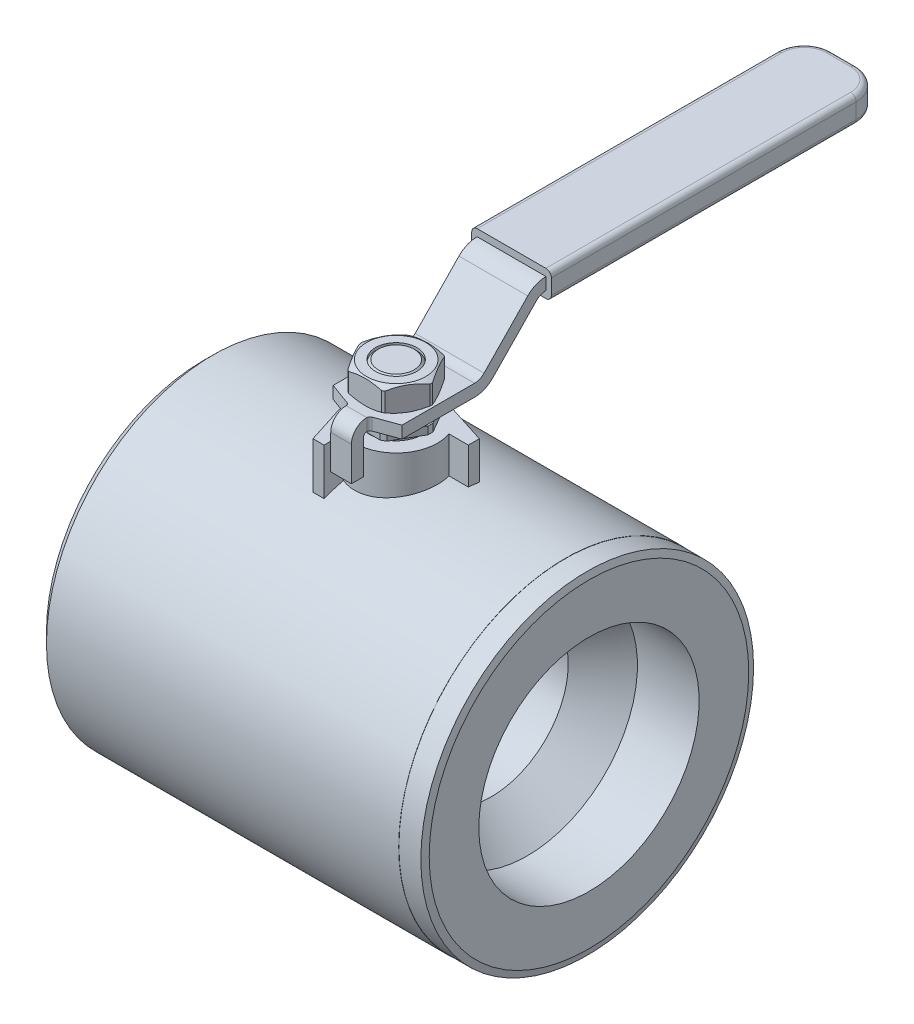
from build123d import *

# Parameters (mm, degrees)
SKETCH7_R          = 18.455087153
CUT_EXTRUDE4_DEPTH = 15.24
EXTRUDE2_DEPTH     = 7.9375
FILLET4_R          = 4.7625
SKETCH9_W          = 76.625038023
SKETCH9_H          = 6.0452
EXTRUDE3_DEPTH     = 9.1821
FILLET5_R          = 6.35
FILLET6_R          = 1.27
CUT_EXTRUDE5_DEPTH = 12.7
EXTRUDE1_START     = 2.54
EXTRUDE1_DEPTH     = 20.574


with BuildPart() as part:
    # Sketch1 → Revolve1 (revolve)
    with BuildSketch(Plane.XY, mode=Mode.PRIVATE) as revolve1_sk:
        Polygon((-30.226, 1.852523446), (-21.937881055, -5.806854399), (21.937881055, -5.806854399), (30.226, 1.852523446), (31.496, 1.852523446), (44.45, 1.852523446), (44.45, 13.282523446), (44.041645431, 14.806523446), (38.989, 14.806523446), (38.989, 14.859), (-42.2148, 14.859), (-44.45, 12.6238), (-44.45, 1.852523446), (-31.496, 1.852523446), align=None)
    revolve(revolve1_sk.sketch.rotate(Axis((-26.37659844, -23.547476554, 0), (1, 0, 0)), 90), axis=Axis((-26.37659844, -23.547476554, 0), (1, 0, 0)))

    # Sketch6 → Revolve2 (revolve)
    with BuildSketch(Plane.XY, mode=Mode.PRIVATE) as revolve2_sk:
        Polygon((0, 12.7), (6.096, 12.7), (6.096, 24.257), (7.9375, 24.257), (7.9375, 26.035), (4.7625, 26.035), (4.7625, 29.21), (6.8199, 29.21), (8.0899, 29.943234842), (8.0899, 34.318765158), (6.8199, 35.052), (4.7625, 35.052), (4.7625, 34.417), (4.1275, 35.052), (0, 35.052), align=None)
    revolve(revolve2_sk.sketch.rotate(Axis((0, 12.7, 0), (0, -1, 0)), 180), axis=Axis((0, 12.7, 0), (0, -1, 0)))

    # Sketch7 → Cut-Extrude4 (cut)
    with BuildSketch(Plane(origin=(0, 35.052, 0), x_dir=(-1, 0, 0), z_dir=(0, 1, 0))):
        Circle(SKETCH7_R)
        Polygon((4.124445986, 7.14375), (-4.124445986, 7.14375), (-8.248891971, 0), (-4.124445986, -7.14375), (4.124445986, -7.14375), (8.248891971, 0), align=None, mode=Mode.SUBTRACT)
    extrude(amount=-CUT_EXTRUDE4_DEPTH, mode=Mode.SUBTRACT)

    # Sketch8 → Extrude2 (add, symmetric)
    with BuildSketch(Plane(origin=(0, 0, 0), x_dir=(0, 0, -1), z_dir=(1, 0, 0))):
        with BuildLine():
            Line((-9.906, 17.78), (-9.906, 25.654))
            ThreePointArc((-9.906, 25.654), (-9.682815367, 26.192815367), (-9.144, 26.416))
            Line((-9.144, 26.416), (10.141011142, 26.416))
            ThreePointArc((10.141011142, 26.416), (12.416465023, 26.877361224), (14.332519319, 28.188574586))
            Line((14.332519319, 28.188574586), (24.413688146, 38.572178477))
            ThreePointArc((24.413688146, 38.572178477), (25.413368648, 39.256289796), (26.600561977, 39.497))
            Line((26.600561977, 39.497), (101.6, 39.497))
            Line((101.6, 39.497), (101.6, 42.291))
            Line((101.6, 42.291), (26.600561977, 42.291))
            ThreePointArc((26.600561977, 42.291), (24.325108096, 41.829638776), (22.4090538, 40.518425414))
            Line((22.4090538, 40.518425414), (12.327884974, 30.134821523))
            ThreePointArc((12.327884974, 30.134821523), (11.328204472, 29.450710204), (10.141011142, 29.21))
            Line((10.141011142, 29.21), (-9.144, 29.21))
            ThreePointArc((-9.144, 29.21), (-11.658471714, 28.168471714), (-12.7, 25.654))
            Line((-12.7, 25.654), (-12.7, 17.78))
            Line((-12.7, 17.78), (-9.906, 17.78))
        make_face()
    extrude(amount=EXTRUDE2_DEPTH, both=True)

    # Fillet4
    fillet4_edges = [part.edges().sort_by_distance(p)[0] for p in [
        (-7.9375, 40.894, -101.6),
        (7.9375, 40.894, -101.6),
    ]]
    fillet(fillet4_edges, radius=FILLET4_R)

    # Sketch9 → Extrude3 (add, symmetric)
    with BuildSketch(Plane(origin=(0, 0, 0), x_dir=(0, 0, -1), z_dir=(1, 0, 0))):
        with Locations((64.913080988, 40.894)):
            Rectangle(SKETCH9_W, SKETCH9_H)
    extrude(amount=EXTRUDE3_DEPTH, both=True)

    # Fillet5
    fillet5_edges = [part.edges().sort_by_distance(p)[0] for p in [
        (-9.1821, 40.894, -103.2256),
        (9.1821, 40.894, -103.2256),
    ]]
    fillet(fillet5_edges, radius=FILLET5_R)

    # Fillet6
    fillet6_edges = [part.edges().sort_by_distance(p)[0] for p in [
        (-9.1821, 37.8714, -61.738080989),
        (9.1821, 37.8714, -61.738080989),
        (0, 43.9166, -103.2256),
        (0, 37.8714, -103.2256),
        (-9.1821, 43.9166, -61.738080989),
        (9.1821, 43.9166, -61.738080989),
        (7.322228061, 43.9166, -101.365728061),
        (-7.322228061, 43.9166, -101.365728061),
        (7.322228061, 37.8714, -101.365728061),
        (-7.322228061, 37.8714, -101.365728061),
    ]]
    fillet(fillet6_edges, radius=FILLET6_R)

    # Sketch10 → Cut-Extrude5 (cut)
    with BuildSketch(Plane(origin=(0, 29.21, 0), x_dir=(-1, 0, 0), z_dir=(0, 1, 0))):
        with BuildLine():
            Line((-7.9375, 12.7), (-2.38125, 12.7))
            Line((-2.38125, 12.7), (-2.38125, 9.144))
            ThreePointArc((-2.38125, 9.144), (-2.519056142, 8.706934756), (-2.882630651, 8.427954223))
            Line((-2.882630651, 8.427954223), (-7.9375, 6.588132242))
            Line((-7.9375, 6.588132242), (-7.9375, 12.7))
        make_face()
        with BuildLine():
            Line((7.9375, 6.588132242), (7.9375, 12.7))
            Line((7.9375, 12.7), (2.38125, 12.7))
            Line((2.38125, 12.7), (2.38125, 9.144))
            ThreePointArc((2.38125, 9.144), (2.519056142, 8.706934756), (2.882630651, 8.427954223))
            Line((2.882630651, 8.427954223), (7.9375, 6.588132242))
        make_face()
    extrude(amount=-CUT_EXTRUDE5_DEPTH, mode=Mode.SUBTRACT)

    # Sketch4 → Extrude1 (add)
    with BuildSketch(Plane(origin=(0, 0, 0), x_dir=(1, 0, 0), z_dir=(0, 1, 0)).offset(EXTRUDE1_START)):
        with BuildLine():
            Line((-3.175, -8.980256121), (-3.175, -13.462))
            Line((-3.175, -13.462), (-5.715, -13.462))
            Line((-5.715, -13.462), (-9.07732009, -2.885807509))
            ThreePointArc((-9.07732009, -2.885807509), (-6.735192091, 6.735192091), (2.885807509, 9.07732009))
            Line((2.885807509, 9.07732009), (13.462, 5.715))
            Line((13.462, 5.715), (13.462, 3.175))
            Line((13.462, 3.175), (8.980256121, 3.175))
            ThreePointArc((8.980256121, 3.175), (6.735192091, -6.735192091), (-3.175, -8.980256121))
        make_face()
    extrude(amount=EXTRUDE1_DEPTH)


solid = part.part
